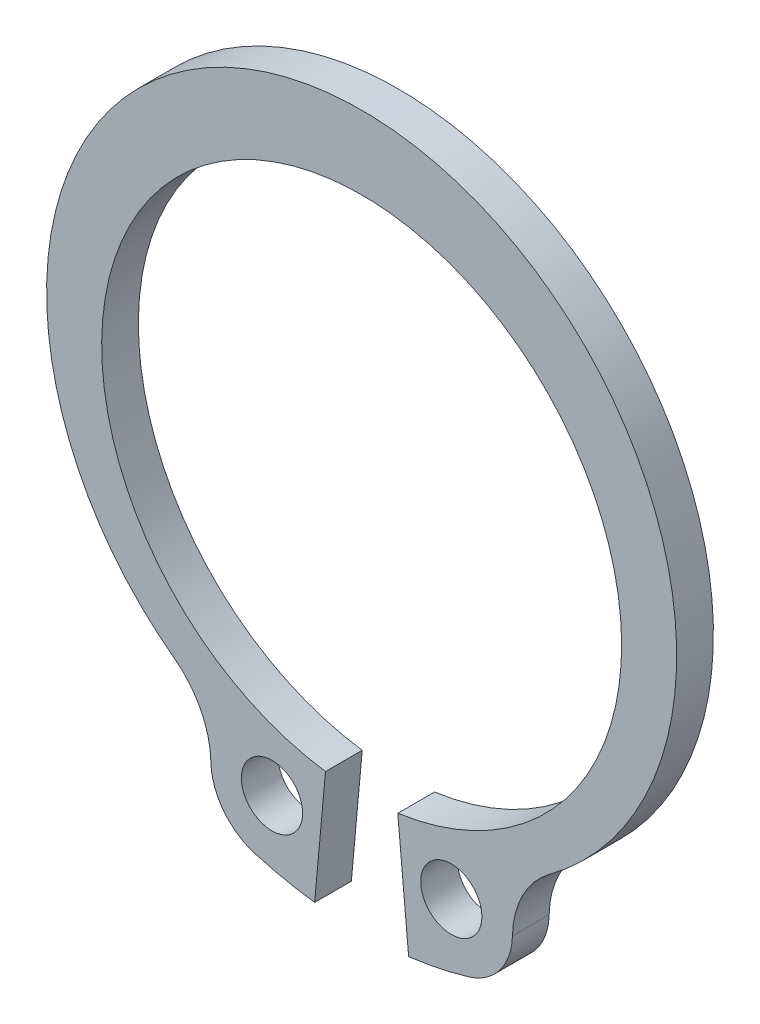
ISO-10303-21;
HEADER;
FILE_DESCRIPTION(('STEP AP214'),'2;1');
FILE_NAME('part.step','',(''),(''),'','','');
FILE_SCHEMA(('AUTOMOTIVE_DESIGN { 1 0 10303 214 1 1 1 1 }'));
ENDSEC;
DATA;
#1=APPLICATION_CONTEXT('core data for automotive mechanical design processes');
#2=APPLICATION_PROTOCOL_DEFINITION('international standard','automotive_design',2000,#1);
#3=PRODUCT_CONTEXT('',#1,'mechanical');
#4=PRODUCT('Part','Part','',(#3));
#5=PRODUCT_RELATED_PRODUCT_CATEGORY('part','',(#4));
#6=PRODUCT_DEFINITION_FORMATION('','',#4);
#7=PRODUCT_DEFINITION_CONTEXT('part definition',#1,'design');
#8=PRODUCT_DEFINITION('design','',#6,#7);
#9=PRODUCT_DEFINITION_SHAPE('','',#8);
#10=(LENGTH_UNIT() NAMED_UNIT(*) SI_UNIT(.MILLI.,.METRE.));
#11=(NAMED_UNIT(*) PLANE_ANGLE_UNIT() SI_UNIT($,.RADIAN.));
#12=(NAMED_UNIT(*) SI_UNIT($,.STERADIAN.) SOLID_ANGLE_UNIT());
#13=UNCERTAINTY_MEASURE_WITH_UNIT(LENGTH_MEASURE(1.E-05),#10,'distance_accuracy_value','');
#14=(GEOMETRIC_REPRESENTATION_CONTEXT(3) GLOBAL_UNCERTAINTY_ASSIGNED_CONTEXT((#13)) GLOBAL_UNIT_ASSIGNED_CONTEXT((#10,
#11,#12)) REPRESENTATION_CONTEXT('',''));
#15=CARTESIAN_POINT('',(0.,0.,0.));
#16=DIRECTION('',(0.,0.,1.));
#17=DIRECTION('',(1.,0.,0.));
#18=AXIS2_PLACEMENT_3D('',#15,#16,#17);
#19=CARTESIAN_POINT('',(0.,0.,1.2));
#20=DIRECTION('',(0.,0.,1.));
#21=DIRECTION('',(1.,0.,0.));
#22=AXIS2_PLACEMENT_3D('',#19,#20,#21);
#23=PLANE('',#22);
#24=CARTESIAN_POINT('',(-2.93047449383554,-9.97531568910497,1.2));
#25=DIRECTION('',(0.,0.,1.));
#26=DIRECTION('',(-1.,0.,0.));
#27=AXIS2_PLACEMENT_3D('',#24,#25,#26);
#28=CIRCLE('',#27,1.);
#29=CARTESIAN_POINT('',(-3.93047449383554,-9.97531568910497,1.2));
#30=VERTEX_POINT('',#29);
#31=EDGE_CURVE('E127',#30,#30,#28,.T.);
#32=ORIENTED_EDGE('',*,*,#31,.F.);
#33=EDGE_LOOP('',(#32));
#34=FACE_BOUND('',#33,.T.);
#35=CARTESIAN_POINT('',(0.,0.,1.2));
#36=DIRECTION('',(0.,0.,-1.));
#37=DIRECTION('',(1.,0.,0.));
#38=AXIS2_PLACEMENT_3D('',#35,#36,#37);
#39=CIRCLE('',#38,8.5);
#40=CARTESIAN_POINT('',(-1.1817148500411,-8.41745507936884,1.2));
#41=VERTEX_POINT('',#40);
#42=CARTESIAN_POINT('',(1.1817148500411,-8.41745507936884,1.2));
#43=VERTEX_POINT('',#42);
#44=EDGE_CURVE('E149',#41,#43,#39,.T.);
#45=ORIENTED_EDGE('',*,*,#44,.T.);
#46=DIRECTION('',(0.0908477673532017,-0.995864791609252,0.));
#47=VECTOR('',#46,1.);
#48=CARTESIAN_POINT('',(1.1817148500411,-8.41745507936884,1.2));
#49=LINE('',#48,#47);
#50=CARTESIAN_POINT('',(1.53602114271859,-12.3013277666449,1.2));
#51=VERTEX_POINT('',#50);
#52=EDGE_CURVE('E122',#43,#51,#49,.T.);
#53=ORIENTED_EDGE('',*,*,#52,.T.);
#54=CARTESIAN_POINT('',(0.,0.,1.2));
#55=DIRECTION('',(0.,0.,1.));
#56=DIRECTION('',(1.,0.,0.));
#57=AXIS2_PLACEMENT_3D('',#54,#55,#56);
#58=CIRCLE('',#57,12.3968554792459);
#59=CARTESIAN_POINT('',(3.49419772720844,-11.8942258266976,1.2));
#60=VERTEX_POINT('',#59);
#61=EDGE_CURVE('E152',#51,#60,#58,.T.);
#62=ORIENTED_EDGE('',*,*,#61,.T.);
#63=CARTESIAN_POINT('',(2.93047449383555,-9.97531568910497,1.2));
#64=DIRECTION('',(0.,0.,1.));
#65=DIRECTION('',(1.,0.,0.));
#66=AXIS2_PLACEMENT_3D('',#63,#64,#65);
#67=CIRCLE('',#66,2.);
#68=CARTESIAN_POINT('',(4.9300547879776,-10.0162869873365,1.2));
#69=VERTEX_POINT('',#68);
#70=EDGE_CURVE('E154',#60,#69,#67,.T.);
#71=ORIENTED_EDGE('',*,*,#70,.T.);
#72=CARTESIAN_POINT('',(7.92942522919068,-10.0777439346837,1.2));
#73=DIRECTION('',(0.,0.,-1.));
#74=DIRECTION('',(1.,0.,0.));
#75=AXIS2_PLACEMENT_3D('',#72,#73,#74);
#76=CIRCLE('',#75,3.);
#77=CARTESIAN_POINT('',(6.14083307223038,-7.66923026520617,1.2));
#78=VERTEX_POINT('',#77);
#79=EDGE_CURVE('E156',#69,#78,#76,.T.);
#80=ORIENTED_EDGE('',*,*,#79,.T.);
#81=CARTESIAN_POINT('',(0.,0.6,1.2));
#82=DIRECTION('',(0.,0.,1.));
#83=DIRECTION('',(1.,0.,0.));
#84=AXIS2_PLACEMENT_3D('',#81,#82,#83);
#85=CIRCLE('',#84,10.3);
#86=CARTESIAN_POINT('',(-6.14083307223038,-7.66923026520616,1.2));
#87=VERTEX_POINT('',#86);
#88=EDGE_CURVE('E158',#78,#87,#85,.T.);
#89=ORIENTED_EDGE('',*,*,#88,.T.);
#90=CARTESIAN_POINT('',(-7.92942522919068,-10.0777439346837,1.2));
#91=DIRECTION('',(0.,0.,-1.));
#92=DIRECTION('',(-1.,0.,0.));
#93=AXIS2_PLACEMENT_3D('',#90,#91,#92);
#94=CIRCLE('',#93,3.);
#95=CARTESIAN_POINT('',(-4.9300547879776,-10.0162869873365,1.2));
#96=VERTEX_POINT('',#95);
#97=EDGE_CURVE('E160',#87,#96,#94,.T.);
#98=ORIENTED_EDGE('',*,*,#97,.T.);
#99=CARTESIAN_POINT('',(-2.93047449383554,-9.97531568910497,1.2));
#100=DIRECTION('',(0.,0.,1.));
#101=DIRECTION('',(-1.,0.,0.));
#102=AXIS2_PLACEMENT_3D('',#99,#100,#101);
#103=CIRCLE('',#102,2.);
#104=CARTESIAN_POINT('',(-3.49419772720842,-11.8942258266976,1.2));
#105=VERTEX_POINT('',#104);
#106=EDGE_CURVE('E162',#96,#105,#103,.T.);
#107=ORIENTED_EDGE('',*,*,#106,.T.);
#108=CARTESIAN_POINT('',(0.,0.,1.2));
#109=DIRECTION('',(0.,0.,1.));
#110=DIRECTION('',(-1.,0.,0.));
#111=AXIS2_PLACEMENT_3D('',#108,#109,#110);
#112=CIRCLE('',#111,12.3968554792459);
#113=CARTESIAN_POINT('',(-1.53602114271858,-12.3013277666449,1.2));
#114=VERTEX_POINT('',#113);
#115=EDGE_CURVE('E51',#105,#114,#112,.T.);
#116=ORIENTED_EDGE('',*,*,#115,.T.);
#117=DIRECTION('',(0.0908477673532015,0.995864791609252,0.));
#118=VECTOR('',#117,1.);
#119=CARTESIAN_POINT('',(-1.1817148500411,-8.41745507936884,1.2));
#120=LINE('',#119,#118);
#121=EDGE_CURVE('E46',#114,#41,#120,.T.);
#122=ORIENTED_EDGE('',*,*,#121,.T.);
#123=EDGE_LOOP('',(#45,#53,#62,#71,#80,#89,#98,#107,#116,#122));
#124=FACE_BOUND('',#123,.T.);
#125=CARTESIAN_POINT('',(2.93047449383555,-9.97531568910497,1.2));
#126=DIRECTION('',(0.,0.,1.));
#127=DIRECTION('',(1.,0.,0.));
#128=AXIS2_PLACEMENT_3D('',#125,#126,#127);
#129=CIRCLE('',#128,1.);
#130=CARTESIAN_POINT('',(3.93047449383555,-9.97531568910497,1.2));
#131=VERTEX_POINT('',#130);
#132=EDGE_CURVE('E249',#131,#131,#129,.T.);
#133=ORIENTED_EDGE('',*,*,#132,.F.);
#134=EDGE_LOOP('',(#133));
#135=FACE_BOUND('',#134,.T.);
#136=ADVANCED_FACE('F31',(#34,#124,#135),#23,.T.);
#137=CARTESIAN_POINT('',(0.,0.,0.));
#138=DIRECTION('',(0.,0.,1.));
#139=DIRECTION('',(1.,0.,0.));
#140=AXIS2_PLACEMENT_3D('',#137,#138,#139);
#141=PLANE('',#140);
#142=CARTESIAN_POINT('',(-2.93047449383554,-9.97531568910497,0.));
#143=DIRECTION('',(0.,0.,1.));
#144=DIRECTION('',(-1.,0.,0.));
#145=AXIS2_PLACEMENT_3D('',#142,#143,#144);
#146=CIRCLE('',#145,1.);
#147=CARTESIAN_POINT('',(-3.93047449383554,-9.97531568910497,0.));
#148=VERTEX_POINT('',#147);
#149=EDGE_CURVE('E130',#148,#148,#146,.T.);
#150=ORIENTED_EDGE('',*,*,#149,.T.);
#151=EDGE_LOOP('',(#150));
#152=FACE_BOUND('',#151,.T.);
#153=CARTESIAN_POINT('',(0.,0.,0.));
#154=DIRECTION('',(0.,0.,-1.));
#155=DIRECTION('',(1.,0.,0.));
#156=AXIS2_PLACEMENT_3D('',#153,#154,#155);
#157=CIRCLE('',#156,8.5);
#158=CARTESIAN_POINT('',(-1.1817148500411,-8.41745507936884,0.));
#159=VERTEX_POINT('',#158);
#160=CARTESIAN_POINT('',(1.1817148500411,-8.41745507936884,0.));
#161=VERTEX_POINT('',#160);
#162=EDGE_CURVE('E113',#159,#161,#157,.T.);
#163=ORIENTED_EDGE('',*,*,#162,.F.);
#164=DIRECTION('',(0.0908477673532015,0.995864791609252,0.));
#165=VECTOR('',#164,1.);
#166=CARTESIAN_POINT('',(-1.1817148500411,-8.41745507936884,0.));
#167=LINE('',#166,#165);
#168=CARTESIAN_POINT('',(-1.53602114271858,-12.3013277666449,0.));
#169=VERTEX_POINT('',#168);
#170=EDGE_CURVE('E147',#169,#159,#167,.T.);
#171=ORIENTED_EDGE('',*,*,#170,.F.);
#172=CARTESIAN_POINT('',(0.,0.,0.));
#173=DIRECTION('',(0.,0.,1.));
#174=DIRECTION('',(-1.,0.,0.));
#175=AXIS2_PLACEMENT_3D('',#172,#173,#174);
#176=CIRCLE('',#175,12.3968554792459);
#177=CARTESIAN_POINT('',(-3.49419772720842,-11.8942258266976,0.));
#178=VERTEX_POINT('',#177);
#179=EDGE_CURVE('E145',#178,#169,#176,.T.);
#180=ORIENTED_EDGE('',*,*,#179,.F.);
#181=CARTESIAN_POINT('',(-2.93047449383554,-9.97531568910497,0.));
#182=DIRECTION('',(0.,0.,1.));
#183=DIRECTION('',(-1.,0.,0.));
#184=AXIS2_PLACEMENT_3D('',#181,#182,#183);
#185=CIRCLE('',#184,2.);
#186=CARTESIAN_POINT('',(-4.9300547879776,-10.0162869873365,0.));
#187=VERTEX_POINT('',#186);
#188=EDGE_CURVE('E143',#187,#178,#185,.T.);
#189=ORIENTED_EDGE('',*,*,#188,.F.);
#190=CARTESIAN_POINT('',(-7.92942522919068,-10.0777439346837,0.));
#191=DIRECTION('',(0.,0.,-1.));
#192=DIRECTION('',(-1.,0.,0.));
#193=AXIS2_PLACEMENT_3D('',#190,#191,#192);
#194=CIRCLE('',#193,3.);
#195=CARTESIAN_POINT('',(-6.14083307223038,-7.66923026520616,0.));
#196=VERTEX_POINT('',#195);
#197=EDGE_CURVE('E141',#196,#187,#194,.T.);
#198=ORIENTED_EDGE('',*,*,#197,.F.);
#199=CARTESIAN_POINT('',(0.,0.6,0.));
#200=DIRECTION('',(0.,0.,1.));
#201=DIRECTION('',(1.,0.,0.));
#202=AXIS2_PLACEMENT_3D('',#199,#200,#201);
#203=CIRCLE('',#202,10.3);
#204=CARTESIAN_POINT('',(6.14083307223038,-7.66923026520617,0.));
#205=VERTEX_POINT('',#204);
#206=EDGE_CURVE('E139',#205,#196,#203,.T.);
#207=ORIENTED_EDGE('',*,*,#206,.F.);
#208=CARTESIAN_POINT('',(7.92942522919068,-10.0777439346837,0.));
#209=DIRECTION('',(0.,0.,-1.));
#210=DIRECTION('',(1.,0.,0.));
#211=AXIS2_PLACEMENT_3D('',#208,#209,#210);
#212=CIRCLE('',#211,3.);
#213=CARTESIAN_POINT('',(4.9300547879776,-10.0162869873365,0.));
#214=VERTEX_POINT('',#213);
#215=EDGE_CURVE('E137',#214,#205,#212,.T.);
#216=ORIENTED_EDGE('',*,*,#215,.F.);
#217=CARTESIAN_POINT('',(2.93047449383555,-9.97531568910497,0.));
#218=DIRECTION('',(0.,0.,1.));
#219=DIRECTION('',(1.,0.,0.));
#220=AXIS2_PLACEMENT_3D('',#217,#218,#219);
#221=CIRCLE('',#220,2.);
#222=CARTESIAN_POINT('',(3.49419772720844,-11.8942258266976,0.));
#223=VERTEX_POINT('',#222);
#224=EDGE_CURVE('E135',#223,#214,#221,.T.);
#225=ORIENTED_EDGE('',*,*,#224,.F.);
#226=CARTESIAN_POINT('',(0.,0.,0.));
#227=DIRECTION('',(0.,0.,1.));
#228=DIRECTION('',(1.,0.,0.));
#229=AXIS2_PLACEMENT_3D('',#226,#227,#228);
#230=CIRCLE('',#229,12.3968554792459);
#231=CARTESIAN_POINT('',(1.53602114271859,-12.3013277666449,0.));
#232=VERTEX_POINT('',#231);
#233=EDGE_CURVE('E115',#232,#223,#230,.T.);
#234=ORIENTED_EDGE('',*,*,#233,.F.);
#235=DIRECTION('',(0.0908477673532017,-0.995864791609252,0.));
#236=VECTOR('',#235,1.);
#237=CARTESIAN_POINT('',(1.1817148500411,-8.41745507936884,0.));
#238=LINE('',#237,#236);
#239=EDGE_CURVE('E108',#161,#232,#238,.T.);
#240=ORIENTED_EDGE('',*,*,#239,.F.);
#241=EDGE_LOOP('',(#163,#171,#180,#189,#198,#207,#216,#225,#234,#240));
#242=FACE_BOUND('',#241,.T.);
#243=CARTESIAN_POINT('',(2.93047449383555,-9.97531568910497,0.));
#244=DIRECTION('',(0.,0.,1.));
#245=DIRECTION('',(1.,0.,0.));
#246=AXIS2_PLACEMENT_3D('',#243,#244,#245);
#247=CIRCLE('',#246,1.);
#248=CARTESIAN_POINT('',(3.93047449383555,-9.97531568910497,0.));
#249=VERTEX_POINT('',#248);
#250=EDGE_CURVE('E252',#249,#249,#247,.T.);
#251=ORIENTED_EDGE('',*,*,#250,.T.);
#252=EDGE_LOOP('',(#251));
#253=FACE_BOUND('',#252,.T.);
#254=ADVANCED_FACE('F109',(#152,#242,#253),#141,.F.);
#255=CARTESIAN_POINT('',(0.,0.,1.2));
#256=DIRECTION('',(0.,0.,-1.));
#257=DIRECTION('',(-1.,0.,0.));
#258=AXIS2_PLACEMENT_3D('',#255,#256,#257);
#259=CYLINDRICAL_SURFACE('',#258,8.5);
#260=ORIENTED_EDGE('',*,*,#162,.T.);
#261=DIRECTION('',(0.,0.,-1.));
#262=VECTOR('',#261,1.);
#263=CARTESIAN_POINT('',(1.1817148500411,-8.41745507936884,1.2));
#264=LINE('',#263,#262);
#265=EDGE_CURVE('E11',#43,#161,#264,.T.);
#266=ORIENTED_EDGE('',*,*,#265,.F.);
#267=ORIENTED_EDGE('',*,*,#44,.F.);
#268=DIRECTION('',(0.,0.,-1.));
#269=VECTOR('',#268,1.);
#270=CARTESIAN_POINT('',(-1.1817148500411,-8.41745507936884,1.2));
#271=LINE('',#270,#269);
#272=EDGE_CURVE('E126',#41,#159,#271,.T.);
#273=ORIENTED_EDGE('',*,*,#272,.T.);
#274=EDGE_LOOP('',(#260,#266,#267,#273));
#275=FACE_BOUND('',#274,.T.);
#276=ADVANCED_FACE('F33',(#275),#259,.F.);
#277=CARTESIAN_POINT('',(1.1817148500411,-8.41745507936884,1.2));
#278=DIRECTION('',(0.995864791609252,0.0908477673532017,0.));
#279=DIRECTION('',(-0.0908477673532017,0.995864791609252,0.));
#280=AXIS2_PLACEMENT_3D('',#277,#278,#279);
#281=PLANE('',#280);
#282=ORIENTED_EDGE('',*,*,#239,.T.);
#283=DIRECTION('',(0.,0.,-1.));
#284=VECTOR('',#283,1.);
#285=CARTESIAN_POINT('',(1.53602114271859,-12.3013277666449,1.2));
#286=LINE('',#285,#284);
#287=EDGE_CURVE('E39',#51,#232,#286,.T.);
#288=ORIENTED_EDGE('',*,*,#287,.F.);
#289=ORIENTED_EDGE('',*,*,#52,.F.);
#290=ORIENTED_EDGE('',*,*,#265,.T.);
#291=EDGE_LOOP('',(#282,#288,#289,#290));
#292=FACE_BOUND('',#291,.T.);
#293=ADVANCED_FACE('F121',(#292),#281,.F.);
#294=CARTESIAN_POINT('',(0.,0.,1.2));
#295=DIRECTION('',(0.,0.,-1.));
#296=DIRECTION('',(-1.,0.,0.));
#297=AXIS2_PLACEMENT_3D('',#294,#295,#296);
#298=CYLINDRICAL_SURFACE('',#297,12.3968554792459);
#299=ORIENTED_EDGE('',*,*,#233,.T.);
#300=DIRECTION('',(0.,0.,-1.));
#301=VECTOR('',#300,1.);
#302=CARTESIAN_POINT('',(3.49419772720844,-11.8942258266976,1.2));
#303=LINE('',#302,#301);
#304=EDGE_CURVE('E185',#60,#223,#303,.T.);
#305=ORIENTED_EDGE('',*,*,#304,.F.);
#306=ORIENTED_EDGE('',*,*,#61,.F.);
#307=ORIENTED_EDGE('',*,*,#287,.T.);
#308=EDGE_LOOP('',(#299,#305,#306,#307));
#309=FACE_BOUND('',#308,.T.);
#310=ADVANCED_FACE('F189',(#309),#298,.T.);
#311=CARTESIAN_POINT('',(2.93047449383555,-9.97531568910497,1.2));
#312=DIRECTION('',(0.,0.,-1.));
#313=DIRECTION('',(-1.,0.,0.));
#314=AXIS2_PLACEMENT_3D('',#311,#312,#313);
#315=CYLINDRICAL_SURFACE('',#314,2.);
#316=ORIENTED_EDGE('',*,*,#224,.T.);
#317=DIRECTION('',(0.,0.,-1.));
#318=VECTOR('',#317,1.);
#319=CARTESIAN_POINT('',(4.9300547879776,-10.0162869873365,1.2));
#320=LINE('',#319,#318);
#321=EDGE_CURVE('E182',#69,#214,#320,.T.);
#322=ORIENTED_EDGE('',*,*,#321,.F.);
#323=ORIENTED_EDGE('',*,*,#70,.F.);
#324=ORIENTED_EDGE('',*,*,#304,.T.);
#325=EDGE_LOOP('',(#316,#322,#323,#324));
#326=FACE_BOUND('',#325,.T.);
#327=ADVANCED_FACE('F197',(#326),#315,.T.);
#328=CARTESIAN_POINT('',(7.92942522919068,-10.0777439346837,1.2));
#329=DIRECTION('',(0.,0.,-1.));
#330=DIRECTION('',(-1.,0.,0.));
#331=AXIS2_PLACEMENT_3D('',#328,#329,#330);
#332=CYLINDRICAL_SURFACE('',#331,3.);
#333=ORIENTED_EDGE('',*,*,#215,.T.);
#334=DIRECTION('',(0.,0.,-1.));
#335=VECTOR('',#334,1.);
#336=CARTESIAN_POINT('',(6.14083307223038,-7.66923026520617,1.2));
#337=LINE('',#336,#335);
#338=EDGE_CURVE('E179',#78,#205,#337,.T.);
#339=ORIENTED_EDGE('',*,*,#338,.F.);
#340=ORIENTED_EDGE('',*,*,#79,.F.);
#341=ORIENTED_EDGE('',*,*,#321,.T.);
#342=EDGE_LOOP('',(#333,#339,#340,#341));
#343=FACE_BOUND('',#342,.T.);
#344=ADVANCED_FACE('F200',(#343),#332,.F.);
#345=CARTESIAN_POINT('',(0.,0.6,1.2));
#346=DIRECTION('',(0.,0.,-1.));
#347=DIRECTION('',(-1.,0.,0.));
#348=AXIS2_PLACEMENT_3D('',#345,#346,#347);
#349=CYLINDRICAL_SURFACE('',#348,10.3);
#350=ORIENTED_EDGE('',*,*,#206,.T.);
#351=DIRECTION('',(0.,0.,-1.));
#352=VECTOR('',#351,1.);
#353=CARTESIAN_POINT('',(-6.14083307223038,-7.66923026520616,1.2));
#354=LINE('',#353,#352);
#355=EDGE_CURVE('E176',#87,#196,#354,.T.);
#356=ORIENTED_EDGE('',*,*,#355,.F.);
#357=ORIENTED_EDGE('',*,*,#88,.F.);
#358=ORIENTED_EDGE('',*,*,#338,.T.);
#359=EDGE_LOOP('',(#350,#356,#357,#358));
#360=FACE_BOUND('',#359,.T.);
#361=ADVANCED_FACE('F205',(#360),#349,.T.);
#362=CARTESIAN_POINT('',(-7.92942522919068,-10.0777439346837,1.2));
#363=DIRECTION('',(0.,0.,-1.));
#364=DIRECTION('',(-1.,0.,0.));
#365=AXIS2_PLACEMENT_3D('',#362,#363,#364);
#366=CYLINDRICAL_SURFACE('',#365,3.);
#367=ORIENTED_EDGE('',*,*,#197,.T.);
#368=DIRECTION('',(0.,0.,-1.));
#369=VECTOR('',#368,1.);
#370=CARTESIAN_POINT('',(-4.9300547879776,-10.0162869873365,1.2));
#371=LINE('',#370,#369);
#372=EDGE_CURVE('E173',#96,#187,#371,.T.);
#373=ORIENTED_EDGE('',*,*,#372,.F.);
#374=ORIENTED_EDGE('',*,*,#97,.F.);
#375=ORIENTED_EDGE('',*,*,#355,.T.);
#376=EDGE_LOOP('',(#367,#373,#374,#375));
#377=FACE_BOUND('',#376,.T.);
#378=ADVANCED_FACE('F211',(#377),#366,.F.);
#379=CARTESIAN_POINT('',(-2.93047449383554,-9.97531568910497,1.2));
#380=DIRECTION('',(0.,0.,-1.));
#381=DIRECTION('',(-1.,0.,0.));
#382=AXIS2_PLACEMENT_3D('',#379,#380,#381);
#383=CYLINDRICAL_SURFACE('',#382,2.);
#384=ORIENTED_EDGE('',*,*,#188,.T.);
#385=DIRECTION('',(0.,0.,-1.));
#386=VECTOR('',#385,1.);
#387=CARTESIAN_POINT('',(-3.49419772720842,-11.8942258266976,1.2));
#388=LINE('',#387,#386);
#389=EDGE_CURVE('E170',#105,#178,#388,.T.);
#390=ORIENTED_EDGE('',*,*,#389,.F.);
#391=ORIENTED_EDGE('',*,*,#106,.F.);
#392=ORIENTED_EDGE('',*,*,#372,.T.);
#393=EDGE_LOOP('',(#384,#390,#391,#392));
#394=FACE_BOUND('',#393,.T.);
#395=ADVANCED_FACE('F215',(#394),#383,.T.);
#396=CARTESIAN_POINT('',(0.,0.,1.2));
#397=DIRECTION('',(0.,0.,-1.));
#398=DIRECTION('',(-1.,0.,0.));
#399=AXIS2_PLACEMENT_3D('',#396,#397,#398);
#400=CYLINDRICAL_SURFACE('',#399,12.3968554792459);
#401=ORIENTED_EDGE('',*,*,#179,.T.);
#402=DIRECTION('',(0.,0.,-1.));
#403=VECTOR('',#402,1.);
#404=CARTESIAN_POINT('',(-1.53602114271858,-12.3013277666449,1.2));
#405=LINE('',#404,#403);
#406=EDGE_CURVE('E167',#114,#169,#405,.T.);
#407=ORIENTED_EDGE('',*,*,#406,.F.);
#408=ORIENTED_EDGE('',*,*,#115,.F.);
#409=ORIENTED_EDGE('',*,*,#389,.T.);
#410=EDGE_LOOP('',(#401,#407,#408,#409));
#411=FACE_BOUND('',#410,.T.);
#412=ADVANCED_FACE('F218',(#411),#400,.T.);
#413=CARTESIAN_POINT('',(-1.1817148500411,-8.41745507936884,1.2));
#414=DIRECTION('',(-0.995864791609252,0.0908477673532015,0.));
#415=DIRECTION('',(-0.0908477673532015,-0.995864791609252,0.));
#416=AXIS2_PLACEMENT_3D('',#413,#414,#415);
#417=PLANE('',#416);
#418=ORIENTED_EDGE('',*,*,#170,.T.);
#419=ORIENTED_EDGE('',*,*,#272,.F.);
#420=ORIENTED_EDGE('',*,*,#121,.F.);
#421=ORIENTED_EDGE('',*,*,#406,.T.);
#422=EDGE_LOOP('',(#418,#419,#420,#421));
#423=FACE_BOUND('',#422,.T.);
#424=ADVANCED_FACE('F220',(#423),#417,.F.);
#425=CARTESIAN_POINT('',(-2.93047449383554,-9.97531568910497,1.2));
#426=DIRECTION('',(0.,0.,-1.));
#427=DIRECTION('',(-1.,0.,0.));
#428=AXIS2_PLACEMENT_3D('',#425,#426,#427);
#429=CYLINDRICAL_SURFACE('',#428,1.);
#430=ORIENTED_EDGE('',*,*,#31,.T.);
#431=EDGE_LOOP('',(#430));
#432=FACE_BOUND('',#431,.T.);
#433=ORIENTED_EDGE('',*,*,#149,.F.);
#434=EDGE_LOOP('',(#433));
#435=FACE_BOUND('',#434,.T.);
#436=ADVANCED_FACE('F222',(#432,#435),#429,.F.);
#437=CARTESIAN_POINT('',(2.93047449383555,-9.97531568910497,1.2));
#438=DIRECTION('',(0.,0.,-1.));
#439=DIRECTION('',(-1.,0.,0.));
#440=AXIS2_PLACEMENT_3D('',#437,#438,#439);
#441=CYLINDRICAL_SURFACE('',#440,1.);
#442=ORIENTED_EDGE('',*,*,#132,.T.);
#443=EDGE_LOOP('',(#442));
#444=FACE_BOUND('',#443,.T.);
#445=ORIENTED_EDGE('',*,*,#250,.F.);
#446=EDGE_LOOP('',(#445));
#447=FACE_BOUND('',#446,.T.);
#448=ADVANCED_FACE('F228',(#444,#447),#441,.F.);
#449=CLOSED_SHELL('',(#136,#254,#276,#293,#310,#327,#344,#361,#378,#395,#412,#424,#436,#448));
#450=MANIFOLD_SOLID_BREP('B2',#449);
#451=ADVANCED_BREP_SHAPE_REPRESENTATION('',(#18,#450),#14);
#452=SHAPE_DEFINITION_REPRESENTATION(#9,#451);
ENDSEC;
END-ISO-10303-21;
